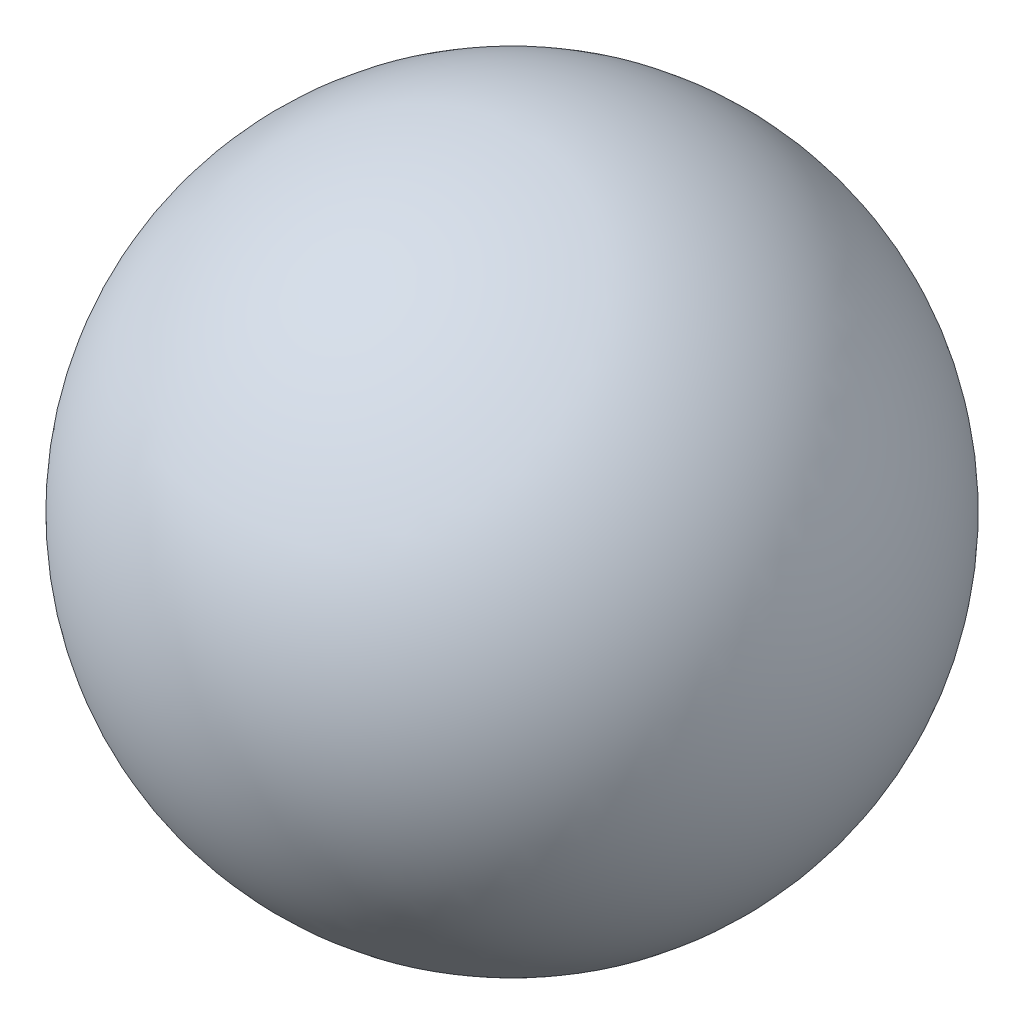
from build123d import *


with BuildPart() as part:
    # Sketch 1 → Revolve 5 (revolve)
    with BuildSketch(Plane.XY):
        with BuildLine():
            Line((0, 8.5), (0, -8.5))
            ThreePointArc((0, -8.5), (8.5, 0), (0, 8.5))
        make_face()
    revolve(axis=Axis((0, 8.5, 0), (0, -1, 0)))


solid = part.part
